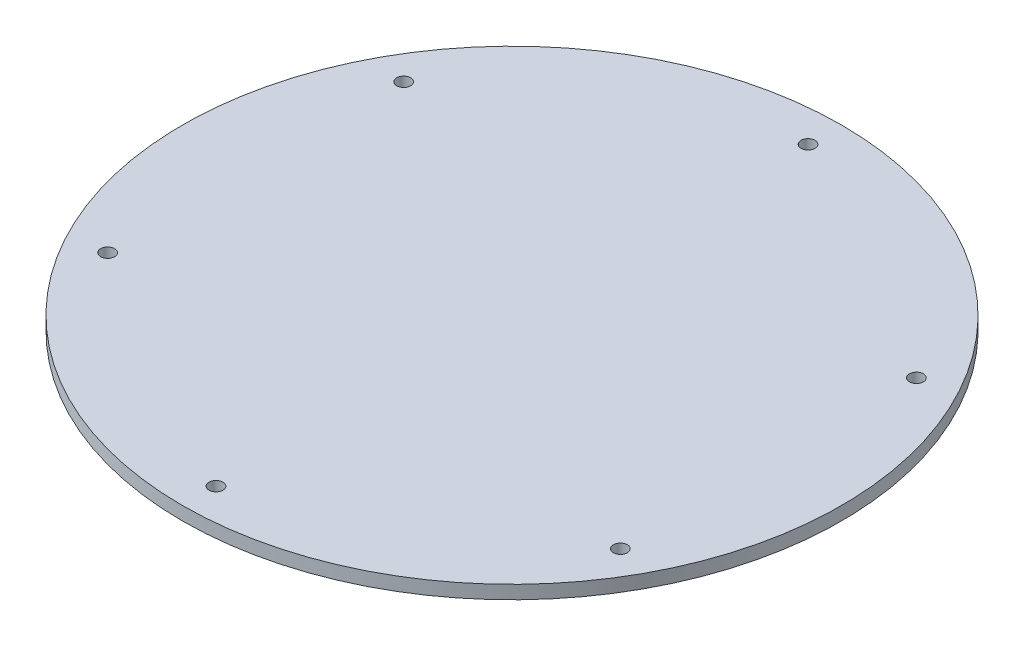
ISO-10303-21;
HEADER;
FILE_DESCRIPTION(('STEP AP214'),'2;1');
FILE_NAME('part.step','',(''),(''),'','','');
FILE_SCHEMA(('AUTOMOTIVE_DESIGN { 1 0 10303 214 1 1 1 1 }'));
ENDSEC;
DATA;
#1=APPLICATION_CONTEXT('core data for automotive mechanical design processes');
#2=APPLICATION_PROTOCOL_DEFINITION('international standard','automotive_design',2000,#1);
#3=PRODUCT_CONTEXT('',#1,'mechanical');
#4=PRODUCT('Part','Part','',(#3));
#5=PRODUCT_RELATED_PRODUCT_CATEGORY('part','',(#4));
#6=PRODUCT_DEFINITION_FORMATION('','',#4);
#7=PRODUCT_DEFINITION_CONTEXT('part definition',#1,'design');
#8=PRODUCT_DEFINITION('design','',#6,#7);
#9=PRODUCT_DEFINITION_SHAPE('','',#8);
#10=(LENGTH_UNIT() NAMED_UNIT(*) SI_UNIT(.MILLI.,.METRE.));
#11=(NAMED_UNIT(*) PLANE_ANGLE_UNIT() SI_UNIT($,.RADIAN.));
#12=(NAMED_UNIT(*) SI_UNIT($,.STERADIAN.) SOLID_ANGLE_UNIT());
#13=UNCERTAINTY_MEASURE_WITH_UNIT(LENGTH_MEASURE(1.E-05),#10,'distance_accuracy_value','');
#14=(GEOMETRIC_REPRESENTATION_CONTEXT(3) GLOBAL_UNCERTAINTY_ASSIGNED_CONTEXT((#13)) GLOBAL_UNIT_ASSIGNED_CONTEXT((#10,
#11,#12)) REPRESENTATION_CONTEXT('',''));
#15=CARTESIAN_POINT('',(0.,0.,0.));
#16=DIRECTION('',(0.,0.,1.));
#17=DIRECTION('',(1.,0.,0.));
#18=AXIS2_PLACEMENT_3D('',#15,#16,#17);
#19=CARTESIAN_POINT('',(0.,6.096,0.));
#20=DIRECTION('',(0.,1.,0.));
#21=DIRECTION('',(0.,0.,1.));
#22=AXIS2_PLACEMENT_3D('',#19,#20,#21);
#23=PLANE('',#22);
#24=CARTESIAN_POINT('',(116.58433985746,6.096,67.3100000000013));
#25=DIRECTION('',(0.,1.,0.));
#26=DIRECTION('',(0.,0.,1.));
#27=AXIS2_PLACEMENT_3D('',#24,#25,#26);
#28=CIRCLE('',#27,3.17500000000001);
#29=CARTESIAN_POINT('',(116.58433985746,6.096,64.1350000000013));
#30=VERTEX_POINT('',#29);
#31=EDGE_CURVE('E63',#30,#30,#28,.T.);
#32=ORIENTED_EDGE('',*,*,#31,.F.);
#33=EDGE_LOOP('',(#32));
#34=FACE_BOUND('',#33,.T.);
#35=CARTESIAN_POINT('',(9.29811783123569E-13,6.096,-134.62));
#36=DIRECTION('',(0.,1.,0.));
#37=DIRECTION('',(0.,0.,1.));
#38=AXIS2_PLACEMENT_3D('',#35,#36,#37);
#39=CIRCLE('',#38,3.17500000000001);
#40=CARTESIAN_POINT('',(9.29811783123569E-13,6.096,-137.795));
#41=VERTEX_POINT('',#40);
#42=EDGE_CURVE('E51',#41,#41,#39,.T.);
#43=ORIENTED_EDGE('',*,*,#42,.F.);
#44=EDGE_LOOP('',(#43));
#45=FACE_BOUND('',#44,.T.);
#46=CARTESIAN_POINT('',(-116.584339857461,6.096,67.3099999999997));
#47=DIRECTION('',(0.,1.,0.));
#48=DIRECTION('',(0.,0.,1.));
#49=AXIS2_PLACEMENT_3D('',#46,#47,#48);
#50=CIRCLE('',#49,3.175);
#51=CARTESIAN_POINT('',(-116.584339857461,6.096,64.1349999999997));
#52=VERTEX_POINT('',#51);
#53=EDGE_CURVE('E40',#52,#52,#50,.T.);
#54=ORIENTED_EDGE('',*,*,#53,.F.);
#55=EDGE_LOOP('',(#54));
#56=FACE_BOUND('',#55,.T.);
#57=CARTESIAN_POINT('',(0.,6.096,0.));
#58=DIRECTION('',(0.,1.,0.));
#59=DIRECTION('',(0.,0.,1.));
#60=AXIS2_PLACEMENT_3D('',#57,#58,#59);
#61=CIRCLE('',#60,149.86);
#62=CARTESIAN_POINT('',(0.,6.096,-149.86));
#63=VERTEX_POINT('',#62);
#64=EDGE_CURVE('E10',#63,#63,#61,.T.);
#65=ORIENTED_EDGE('',*,*,#64,.T.);
#66=EDGE_LOOP('',(#65));
#67=FACE_BOUND('',#66,.T.);
#68=CARTESIAN_POINT('',(-116.584339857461,6.096,-67.3100000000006));
#69=DIRECTION('',(0.,1.,0.));
#70=DIRECTION('',(0.,0.,1.));
#71=AXIS2_PLACEMENT_3D('',#68,#69,#70);
#72=CIRCLE('',#71,3.17499999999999);
#73=CARTESIAN_POINT('',(-116.584339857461,6.096,-70.4850000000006));
#74=VERTEX_POINT('',#73);
#75=EDGE_CURVE('E45',#74,#74,#72,.T.);
#76=ORIENTED_EDGE('',*,*,#75,.F.);
#77=EDGE_LOOP('',(#76));
#78=FACE_BOUND('',#77,.T.);
#79=CARTESIAN_POINT('',(116.584339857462,6.096,-67.3099999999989));
#80=DIRECTION('',(0.,1.,0.));
#81=DIRECTION('',(0.,0.,1.));
#82=AXIS2_PLACEMENT_3D('',#79,#80,#81);
#83=CIRCLE('',#82,3.175);
#84=CARTESIAN_POINT('',(116.584339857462,6.096,-70.4849999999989));
#85=VERTEX_POINT('',#84);
#86=EDGE_CURVE('E57',#85,#85,#83,.T.);
#87=ORIENTED_EDGE('',*,*,#86,.F.);
#88=EDGE_LOOP('',(#87));
#89=FACE_BOUND('',#88,.T.);
#90=CARTESIAN_POINT('',(-1.88044024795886E-12,6.096,134.62));
#91=DIRECTION('',(0.,1.,0.));
#92=DIRECTION('',(0.,0.,1.));
#93=AXIS2_PLACEMENT_3D('',#90,#91,#92);
#94=CIRCLE('',#93,3.17499999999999);
#95=CARTESIAN_POINT('',(-1.88044024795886E-12,6.096,131.445));
#96=VERTEX_POINT('',#95);
#97=EDGE_CURVE('E69',#96,#96,#94,.T.);
#98=ORIENTED_EDGE('',*,*,#97,.F.);
#99=EDGE_LOOP('',(#98));
#100=FACE_BOUND('',#99,.T.);
#101=ADVANCED_FACE('F29',(#34,#45,#56,#67,#78,#89,#100),#23,.T.);
#102=CARTESIAN_POINT('',(0.,0.,0.));
#103=DIRECTION('',(0.,1.,0.));
#104=DIRECTION('',(0.,0.,1.));
#105=AXIS2_PLACEMENT_3D('',#102,#103,#104);
#106=PLANE('',#105);
#107=CARTESIAN_POINT('',(116.58433985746,0.,67.3100000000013));
#108=DIRECTION('',(0.,1.,0.));
#109=DIRECTION('',(0.,0.,1.));
#110=AXIS2_PLACEMENT_3D('',#107,#108,#109);
#111=CIRCLE('',#110,3.17500000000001);
#112=CARTESIAN_POINT('',(116.58433985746,0.,64.1350000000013));
#113=VERTEX_POINT('',#112);
#114=EDGE_CURVE('E66',#113,#113,#111,.T.);
#115=ORIENTED_EDGE('',*,*,#114,.T.);
#116=EDGE_LOOP('',(#115));
#117=FACE_BOUND('',#116,.T.);
#118=CARTESIAN_POINT('',(9.29811783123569E-13,0.,-134.62));
#119=DIRECTION('',(0.,1.,0.));
#120=DIRECTION('',(0.,0.,1.));
#121=AXIS2_PLACEMENT_3D('',#118,#119,#120);
#122=CIRCLE('',#121,3.17500000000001);
#123=CARTESIAN_POINT('',(9.29811783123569E-13,0.,-137.795));
#124=VERTEX_POINT('',#123);
#125=EDGE_CURVE('E54',#124,#124,#122,.T.);
#126=ORIENTED_EDGE('',*,*,#125,.T.);
#127=EDGE_LOOP('',(#126));
#128=FACE_BOUND('',#127,.T.);
#129=CARTESIAN_POINT('',(-116.584339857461,0.,67.3099999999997));
#130=DIRECTION('',(0.,1.,0.));
#131=DIRECTION('',(0.,0.,1.));
#132=AXIS2_PLACEMENT_3D('',#129,#130,#131);
#133=CIRCLE('',#132,3.175);
#134=CARTESIAN_POINT('',(-116.584339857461,0.,64.1349999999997));
#135=VERTEX_POINT('',#134);
#136=EDGE_CURVE('E42',#135,#135,#133,.T.);
#137=ORIENTED_EDGE('',*,*,#136,.T.);
#138=EDGE_LOOP('',(#137));
#139=FACE_BOUND('',#138,.T.);
#140=CARTESIAN_POINT('',(0.,0.,0.));
#141=DIRECTION('',(0.,1.,0.));
#142=DIRECTION('',(0.,0.,1.));
#143=AXIS2_PLACEMENT_3D('',#140,#141,#142);
#144=CIRCLE('',#143,149.86);
#145=CARTESIAN_POINT('',(0.,0.,-149.86));
#146=VERTEX_POINT('',#145);
#147=EDGE_CURVE('E33',#146,#146,#144,.T.);
#148=ORIENTED_EDGE('',*,*,#147,.F.);
#149=EDGE_LOOP('',(#148));
#150=FACE_BOUND('',#149,.T.);
#151=CARTESIAN_POINT('',(-116.584339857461,0.,-67.3100000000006));
#152=DIRECTION('',(0.,1.,0.));
#153=DIRECTION('',(0.,0.,1.));
#154=AXIS2_PLACEMENT_3D('',#151,#152,#153);
#155=CIRCLE('',#154,3.17499999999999);
#156=CARTESIAN_POINT('',(-116.584339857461,0.,-70.4850000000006));
#157=VERTEX_POINT('',#156);
#158=EDGE_CURVE('E48',#157,#157,#155,.T.);
#159=ORIENTED_EDGE('',*,*,#158,.T.);
#160=EDGE_LOOP('',(#159));
#161=FACE_BOUND('',#160,.T.);
#162=CARTESIAN_POINT('',(116.584339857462,0.,-67.3099999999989));
#163=DIRECTION('',(0.,1.,0.));
#164=DIRECTION('',(0.,0.,1.));
#165=AXIS2_PLACEMENT_3D('',#162,#163,#164);
#166=CIRCLE('',#165,3.175);
#167=CARTESIAN_POINT('',(116.584339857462,0.,-70.4849999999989));
#168=VERTEX_POINT('',#167);
#169=EDGE_CURVE('E60',#168,#168,#166,.T.);
#170=ORIENTED_EDGE('',*,*,#169,.T.);
#171=EDGE_LOOP('',(#170));
#172=FACE_BOUND('',#171,.T.);
#173=CARTESIAN_POINT('',(-1.88044024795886E-12,0.,134.62));
#174=DIRECTION('',(0.,1.,0.));
#175=DIRECTION('',(0.,0.,1.));
#176=AXIS2_PLACEMENT_3D('',#173,#174,#175);
#177=CIRCLE('',#176,3.17499999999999);
#178=CARTESIAN_POINT('',(-1.88044024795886E-12,0.,131.445));
#179=VERTEX_POINT('',#178);
#180=EDGE_CURVE('E72',#179,#179,#177,.T.);
#181=ORIENTED_EDGE('',*,*,#180,.T.);
#182=EDGE_LOOP('',(#181));
#183=FACE_BOUND('',#182,.T.);
#184=ADVANCED_FACE('F82',(#117,#128,#139,#150,#161,#172,#183),#106,.F.);
#185=CARTESIAN_POINT('',(0.,6.096,0.));
#186=DIRECTION('',(0.,-1.,0.));
#187=DIRECTION('',(0.,0.,-1.));
#188=AXIS2_PLACEMENT_3D('',#185,#186,#187);
#189=CYLINDRICAL_SURFACE('',#188,149.86);
#190=CARTESIAN_POINT('',(0.,6.096,-149.86));
#191=CARTESIAN_POINT('',(0.,6.0325,-149.86));
#192=CARTESIAN_POINT('',(0.,5.969,-149.86));
#193=CARTESIAN_POINT('',(0.,5.842,-149.86));
#194=CARTESIAN_POINT('',(0.,5.7785,-149.86));
#195=CARTESIAN_POINT('',(0.,5.6515,-149.86));
#196=CARTESIAN_POINT('',(0.,5.588,-149.86));
#197=CARTESIAN_POINT('',(0.,5.461,-149.86));
#198=CARTESIAN_POINT('',(0.,5.3975,-149.86));
#199=CARTESIAN_POINT('',(0.,5.2705,-149.86));
#200=CARTESIAN_POINT('',(0.,5.207,-149.86));
#201=CARTESIAN_POINT('',(0.,5.08,-149.86));
#202=CARTESIAN_POINT('',(0.,5.0165,-149.86));
#203=CARTESIAN_POINT('',(0.,4.8895,-149.86));
#204=CARTESIAN_POINT('',(0.,4.826,-149.86));
#205=CARTESIAN_POINT('',(0.,4.699,-149.86));
#206=CARTESIAN_POINT('',(0.,4.6355,-149.86));
#207=CARTESIAN_POINT('',(0.,4.5085,-149.86));
#208=CARTESIAN_POINT('',(0.,4.445,-149.86));
#209=CARTESIAN_POINT('',(0.,4.318,-149.86));
#210=CARTESIAN_POINT('',(0.,4.2545,-149.86));
#211=CARTESIAN_POINT('',(0.,4.1275,-149.86));
#212=CARTESIAN_POINT('',(0.,4.064,-149.86));
#213=CARTESIAN_POINT('',(0.,3.937,-149.86));
#214=CARTESIAN_POINT('',(0.,3.8735,-149.86));
#215=CARTESIAN_POINT('',(0.,3.7465,-149.86));
#216=CARTESIAN_POINT('',(0.,3.683,-149.86));
#217=CARTESIAN_POINT('',(0.,3.556,-149.86));
#218=CARTESIAN_POINT('',(0.,3.4925,-149.86));
#219=CARTESIAN_POINT('',(0.,3.3655,-149.86));
#220=CARTESIAN_POINT('',(0.,3.302,-149.86));
#221=CARTESIAN_POINT('',(0.,3.175,-149.86));
#222=CARTESIAN_POINT('',(0.,3.1115,-149.86));
#223=CARTESIAN_POINT('',(0.,2.9845,-149.86));
#224=CARTESIAN_POINT('',(0.,2.921,-149.86));
#225=CARTESIAN_POINT('',(0.,2.794,-149.86));
#226=CARTESIAN_POINT('',(0.,2.7305,-149.86));
#227=CARTESIAN_POINT('',(0.,2.6035,-149.86));
#228=CARTESIAN_POINT('',(0.,2.54,-149.86));
#229=CARTESIAN_POINT('',(0.,2.413,-149.86));
#230=CARTESIAN_POINT('',(0.,2.3495,-149.86));
#231=CARTESIAN_POINT('',(0.,2.2225,-149.86));
#232=CARTESIAN_POINT('',(0.,2.159,-149.86));
#233=CARTESIAN_POINT('',(0.,2.032,-149.86));
#234=CARTESIAN_POINT('',(0.,1.9685,-149.86));
#235=CARTESIAN_POINT('',(0.,1.8415,-149.86));
#236=CARTESIAN_POINT('',(0.,1.778,-149.86));
#237=CARTESIAN_POINT('',(0.,1.651,-149.86));
#238=CARTESIAN_POINT('',(0.,1.5875,-149.86));
#239=CARTESIAN_POINT('',(0.,1.4605,-149.86));
#240=CARTESIAN_POINT('',(0.,1.397,-149.86));
#241=CARTESIAN_POINT('',(0.,1.27,-149.86));
#242=CARTESIAN_POINT('',(0.,1.2065,-149.86));
#243=CARTESIAN_POINT('',(0.,1.0795,-149.86));
#244=CARTESIAN_POINT('',(0.,1.016,-149.86));
#245=CARTESIAN_POINT('',(0.,0.889,-149.86));
#246=CARTESIAN_POINT('',(0.,0.8255,-149.86));
#247=CARTESIAN_POINT('',(0.,0.6985,-149.86));
#248=CARTESIAN_POINT('',(0.,0.635,-149.86));
#249=CARTESIAN_POINT('',(0.,0.508,-149.86));
#250=CARTESIAN_POINT('',(0.,0.4445,-149.86));
#251=CARTESIAN_POINT('',(0.,0.3175,-149.86));
#252=CARTESIAN_POINT('',(0.,0.254,-149.86));
#253=CARTESIAN_POINT('',(0.,0.127,-149.86));
#254=CARTESIAN_POINT('',(0.,0.0634999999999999,-149.86));
#255=CARTESIAN_POINT('',(0.,0.,-149.86));
#256=B_SPLINE_CURVE_WITH_KNOTS('',3,(#190,#191,#192,#193,#194,#195,#196,#197,#198,#199,#200,
#201,#202,#203,#204,#205,#206,#207,#208,#209,#210,#211,#212,#213,#214,#215,#216,#217,#218,#219,
#220,#221,#222,#223,#224,#225,#226,#227,#228,#229,#230,#231,#232,#233,#234,#235,#236,#237,#238,
#239,#240,#241,#242,#243,#244,#245,#246,#247,#248,#249,#250,#251,#252,#253,#254,#255),
.UNSPECIFIED.,.F.,.F.,(4,2,2,2,2,2,2,2,2,2,2,2,2,2,2,2,2,2,2,2,2,2,2,2,2,2,2,2,2,2,2,2,4),(0.,
0.1905,0.380999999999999,0.571499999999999,0.762,0.952499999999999,1.143,1.3335,1.524,1.7145,
1.905,2.0955,2.286,2.4765,2.667,2.8575,3.048,3.2385,3.429,3.6195,3.81,4.0005,4.191,4.3815,4.572,
4.7625,4.953,5.1435,5.334,5.5245,5.715,5.9055,6.096),.UNSPECIFIED.);
#257=EDGE_CURVE('BSEAM31',#63,#146,#256,.T.);
#258=ORIENTED_EDGE('',*,*,#64,.F.);
#259=ORIENTED_EDGE('',*,*,#147,.T.);
#260=ORIENTED_EDGE('',*,*,#257,.T.);
#261=ORIENTED_EDGE('',*,*,#257,.F.);
#262=EDGE_LOOP('',(#258,#260,#259,#261));
#263=FACE_BOUND('',#262,.T.);
#264=ADVANCED_FACE('F31',(#263),#189,.T.);
#265=CARTESIAN_POINT('',(-116.584339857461,6.096,67.3099999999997));
#266=DIRECTION('',(0.,-1.,0.));
#267=DIRECTION('',(0.,0.,-1.));
#268=AXIS2_PLACEMENT_3D('',#265,#266,#267);
#269=CYLINDRICAL_SURFACE('',#268,3.175);
#270=CARTESIAN_POINT('',(-116.584339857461,6.096,64.1349999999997));
#271=CARTESIAN_POINT('',(-116.584339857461,6.0325,64.1349999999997));
#272=CARTESIAN_POINT('',(-116.584339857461,5.969,64.1349999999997));
#273=CARTESIAN_POINT('',(-116.584339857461,5.842,64.1349999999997));
#274=CARTESIAN_POINT('',(-116.584339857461,5.7785,64.1349999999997));
#275=CARTESIAN_POINT('',(-116.584339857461,5.6515,64.1349999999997));
#276=CARTESIAN_POINT('',(-116.584339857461,5.588,64.1349999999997));
#277=CARTESIAN_POINT('',(-116.584339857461,5.461,64.1349999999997));
#278=CARTESIAN_POINT('',(-116.584339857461,5.3975,64.1349999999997));
#279=CARTESIAN_POINT('',(-116.584339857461,5.2705,64.1349999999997));
#280=CARTESIAN_POINT('',(-116.584339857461,5.207,64.1349999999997));
#281=CARTESIAN_POINT('',(-116.584339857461,5.08,64.1349999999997));
#282=CARTESIAN_POINT('',(-116.584339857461,5.0165,64.1349999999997));
#283=CARTESIAN_POINT('',(-116.584339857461,4.8895,64.1349999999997));
#284=CARTESIAN_POINT('',(-116.584339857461,4.826,64.1349999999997));
#285=CARTESIAN_POINT('',(-116.584339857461,4.699,64.1349999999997));
#286=CARTESIAN_POINT('',(-116.584339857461,4.6355,64.1349999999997));
#287=CARTESIAN_POINT('',(-116.584339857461,4.5085,64.1349999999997));
#288=CARTESIAN_POINT('',(-116.584339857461,4.445,64.1349999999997));
#289=CARTESIAN_POINT('',(-116.584339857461,4.318,64.1349999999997));
#290=CARTESIAN_POINT('',(-116.584339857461,4.2545,64.1349999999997));
#291=CARTESIAN_POINT('',(-116.584339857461,4.1275,64.1349999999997));
#292=CARTESIAN_POINT('',(-116.584339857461,4.064,64.1349999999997));
#293=CARTESIAN_POINT('',(-116.584339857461,3.937,64.1349999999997));
#294=CARTESIAN_POINT('',(-116.584339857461,3.8735,64.1349999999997));
#295=CARTESIAN_POINT('',(-116.584339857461,3.7465,64.1349999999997));
#296=CARTESIAN_POINT('',(-116.584339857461,3.683,64.1349999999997));
#297=CARTESIAN_POINT('',(-116.584339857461,3.556,64.1349999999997));
#298=CARTESIAN_POINT('',(-116.584339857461,3.4925,64.1349999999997));
#299=CARTESIAN_POINT('',(-116.584339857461,3.3655,64.1349999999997));
#300=CARTESIAN_POINT('',(-116.584339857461,3.302,64.1349999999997));
#301=CARTESIAN_POINT('',(-116.584339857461,3.175,64.1349999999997));
#302=CARTESIAN_POINT('',(-116.584339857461,3.1115,64.1349999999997));
#303=CARTESIAN_POINT('',(-116.584339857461,2.9845,64.1349999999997));
#304=CARTESIAN_POINT('',(-116.584339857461,2.921,64.1349999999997));
#305=CARTESIAN_POINT('',(-116.584339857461,2.794,64.1349999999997));
#306=CARTESIAN_POINT('',(-116.584339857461,2.7305,64.1349999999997));
#307=CARTESIAN_POINT('',(-116.584339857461,2.6035,64.1349999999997));
#308=CARTESIAN_POINT('',(-116.584339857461,2.54,64.1349999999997));
#309=CARTESIAN_POINT('',(-116.584339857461,2.413,64.1349999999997));
#310=CARTESIAN_POINT('',(-116.584339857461,2.3495,64.1349999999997));
#311=CARTESIAN_POINT('',(-116.584339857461,2.2225,64.1349999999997));
#312=CARTESIAN_POINT('',(-116.584339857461,2.159,64.1349999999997));
#313=CARTESIAN_POINT('',(-116.584339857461,2.032,64.1349999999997));
#314=CARTESIAN_POINT('',(-116.584339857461,1.9685,64.1349999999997));
#315=CARTESIAN_POINT('',(-116.584339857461,1.8415,64.1349999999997));
#316=CARTESIAN_POINT('',(-116.584339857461,1.778,64.1349999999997));
#317=CARTESIAN_POINT('',(-116.584339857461,1.651,64.1349999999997));
#318=CARTESIAN_POINT('',(-116.584339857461,1.5875,64.1349999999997));
#319=CARTESIAN_POINT('',(-116.584339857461,1.4605,64.1349999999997));
#320=CARTESIAN_POINT('',(-116.584339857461,1.397,64.1349999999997));
#321=CARTESIAN_POINT('',(-116.584339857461,1.27,64.1349999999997));
#322=CARTESIAN_POINT('',(-116.584339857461,1.2065,64.1349999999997));
#323=CARTESIAN_POINT('',(-116.584339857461,1.0795,64.1349999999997));
#324=CARTESIAN_POINT('',(-116.584339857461,1.016,64.1349999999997));
#325=CARTESIAN_POINT('',(-116.584339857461,0.889,64.1349999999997));
#326=CARTESIAN_POINT('',(-116.584339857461,0.8255,64.1349999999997));
#327=CARTESIAN_POINT('',(-116.584339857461,0.6985,64.1349999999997));
#328=CARTESIAN_POINT('',(-116.584339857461,0.635,64.1349999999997));
#329=CARTESIAN_POINT('',(-116.584339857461,0.508,64.1349999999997));
#330=CARTESIAN_POINT('',(-116.584339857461,0.4445,64.1349999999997));
#331=CARTESIAN_POINT('',(-116.584339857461,0.3175,64.1349999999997));
#332=CARTESIAN_POINT('',(-116.584339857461,0.254,64.1349999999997));
#333=CARTESIAN_POINT('',(-116.584339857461,0.127,64.1349999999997));
#334=CARTESIAN_POINT('',(-116.584339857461,0.0634999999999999,64.1349999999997));
#335=CARTESIAN_POINT('',(-116.584339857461,0.,64.1349999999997));
#336=B_SPLINE_CURVE_WITH_KNOTS('',3,(#270,#271,#272,#273,#274,#275,#276,#277,#278,#279,#280,
#281,#282,#283,#284,#285,#286,#287,#288,#289,#290,#291,#292,#293,#294,#295,#296,#297,#298,#299,
#300,#301,#302,#303,#304,#305,#306,#307,#308,#309,#310,#311,#312,#313,#314,#315,#316,#317,#318,
#319,#320,#321,#322,#323,#324,#325,#326,#327,#328,#329,#330,#331,#332,#333,#334,#335),
.UNSPECIFIED.,.F.,.F.,(4,2,2,2,2,2,2,2,2,2,2,2,2,2,2,2,2,2,2,2,2,2,2,2,2,2,2,2,2,2,2,2,4),(0.,
0.1905,0.380999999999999,0.571499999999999,0.762,0.952499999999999,1.143,1.3335,1.524,1.7145,
1.905,2.0955,2.286,2.4765,2.667,2.8575,3.048,3.2385,3.429,3.6195,3.81,4.0005,4.191,4.3815,4.572,
4.7625,4.953,5.1435,5.334,5.5245,5.715,5.9055,6.096),.UNSPECIFIED.);
#337=EDGE_CURVE('BSEAM92',#52,#135,#336,.T.);
#338=ORIENTED_EDGE('',*,*,#53,.T.);
#339=ORIENTED_EDGE('',*,*,#136,.F.);
#340=ORIENTED_EDGE('',*,*,#337,.T.);
#341=ORIENTED_EDGE('',*,*,#337,.F.);
#342=EDGE_LOOP('',(#338,#340,#339,#341));
#343=FACE_BOUND('',#342,.T.);
#344=ADVANCED_FACE('F92',(#343),#269,.F.);
#345=CARTESIAN_POINT('',(-116.584339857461,6.096,-67.3100000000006));
#346=DIRECTION('',(0.,-1.,0.));
#347=DIRECTION('',(0.,0.,-1.));
#348=AXIS2_PLACEMENT_3D('',#345,#346,#347);
#349=CYLINDRICAL_SURFACE('',#348,3.17499999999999);
#350=CARTESIAN_POINT('',(-116.584339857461,6.096,-70.4850000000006));
#351=CARTESIAN_POINT('',(-116.584339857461,6.0325,-70.4850000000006));
#352=CARTESIAN_POINT('',(-116.584339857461,5.969,-70.4850000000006));
#353=CARTESIAN_POINT('',(-116.584339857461,5.842,-70.4850000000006));
#354=CARTESIAN_POINT('',(-116.584339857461,5.7785,-70.4850000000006));
#355=CARTESIAN_POINT('',(-116.584339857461,5.6515,-70.4850000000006));
#356=CARTESIAN_POINT('',(-116.584339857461,5.588,-70.4850000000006));
#357=CARTESIAN_POINT('',(-116.584339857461,5.461,-70.4850000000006));
#358=CARTESIAN_POINT('',(-116.584339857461,5.3975,-70.4850000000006));
#359=CARTESIAN_POINT('',(-116.584339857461,5.2705,-70.4850000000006));
#360=CARTESIAN_POINT('',(-116.584339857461,5.207,-70.4850000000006));
#361=CARTESIAN_POINT('',(-116.584339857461,5.08,-70.4850000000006));
#362=CARTESIAN_POINT('',(-116.584339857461,5.0165,-70.4850000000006));
#363=CARTESIAN_POINT('',(-116.584339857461,4.8895,-70.4850000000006));
#364=CARTESIAN_POINT('',(-116.584339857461,4.826,-70.4850000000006));
#365=CARTESIAN_POINT('',(-116.584339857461,4.699,-70.4850000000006));
#366=CARTESIAN_POINT('',(-116.584339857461,4.6355,-70.4850000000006));
#367=CARTESIAN_POINT('',(-116.584339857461,4.5085,-70.4850000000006));
#368=CARTESIAN_POINT('',(-116.584339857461,4.445,-70.4850000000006));
#369=CARTESIAN_POINT('',(-116.584339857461,4.318,-70.4850000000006));
#370=CARTESIAN_POINT('',(-116.584339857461,4.2545,-70.4850000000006));
#371=CARTESIAN_POINT('',(-116.584339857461,4.1275,-70.4850000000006));
#372=CARTESIAN_POINT('',(-116.584339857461,4.064,-70.4850000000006));
#373=CARTESIAN_POINT('',(-116.584339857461,3.937,-70.4850000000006));
#374=CARTESIAN_POINT('',(-116.584339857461,3.8735,-70.4850000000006));
#375=CARTESIAN_POINT('',(-116.584339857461,3.7465,-70.4850000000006));
#376=CARTESIAN_POINT('',(-116.584339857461,3.683,-70.4850000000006));
#377=CARTESIAN_POINT('',(-116.584339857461,3.556,-70.4850000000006));
#378=CARTESIAN_POINT('',(-116.584339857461,3.4925,-70.4850000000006));
#379=CARTESIAN_POINT('',(-116.584339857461,3.3655,-70.4850000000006));
#380=CARTESIAN_POINT('',(-116.584339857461,3.302,-70.4850000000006));
#381=CARTESIAN_POINT('',(-116.584339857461,3.175,-70.4850000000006));
#382=CARTESIAN_POINT('',(-116.584339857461,3.1115,-70.4850000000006));
#383=CARTESIAN_POINT('',(-116.584339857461,2.9845,-70.4850000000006));
#384=CARTESIAN_POINT('',(-116.584339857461,2.921,-70.4850000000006));
#385=CARTESIAN_POINT('',(-116.584339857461,2.794,-70.4850000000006));
#386=CARTESIAN_POINT('',(-116.584339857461,2.7305,-70.4850000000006));
#387=CARTESIAN_POINT('',(-116.584339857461,2.6035,-70.4850000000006));
#388=CARTESIAN_POINT('',(-116.584339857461,2.54,-70.4850000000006));
#389=CARTESIAN_POINT('',(-116.584339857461,2.413,-70.4850000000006));
#390=CARTESIAN_POINT('',(-116.584339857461,2.3495,-70.4850000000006));
#391=CARTESIAN_POINT('',(-116.584339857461,2.2225,-70.4850000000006));
#392=CARTESIAN_POINT('',(-116.584339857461,2.159,-70.4850000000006));
#393=CARTESIAN_POINT('',(-116.584339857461,2.032,-70.4850000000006));
#394=CARTESIAN_POINT('',(-116.584339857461,1.9685,-70.4850000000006));
#395=CARTESIAN_POINT('',(-116.584339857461,1.8415,-70.4850000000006));
#396=CARTESIAN_POINT('',(-116.584339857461,1.778,-70.4850000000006));
#397=CARTESIAN_POINT('',(-116.584339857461,1.651,-70.4850000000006));
#398=CARTESIAN_POINT('',(-116.584339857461,1.5875,-70.4850000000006));
#399=CARTESIAN_POINT('',(-116.584339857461,1.4605,-70.4850000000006));
#400=CARTESIAN_POINT('',(-116.584339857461,1.397,-70.4850000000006));
#401=CARTESIAN_POINT('',(-116.584339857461,1.27,-70.4850000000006));
#402=CARTESIAN_POINT('',(-116.584339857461,1.2065,-70.4850000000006));
#403=CARTESIAN_POINT('',(-116.584339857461,1.0795,-70.4850000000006));
#404=CARTESIAN_POINT('',(-116.584339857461,1.016,-70.4850000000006));
#405=CARTESIAN_POINT('',(-116.584339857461,0.889,-70.4850000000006));
#406=CARTESIAN_POINT('',(-116.584339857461,0.8255,-70.4850000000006));
#407=CARTESIAN_POINT('',(-116.584339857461,0.6985,-70.4850000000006));
#408=CARTESIAN_POINT('',(-116.584339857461,0.635,-70.4850000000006));
#409=CARTESIAN_POINT('',(-116.584339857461,0.508,-70.4850000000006));
#410=CARTESIAN_POINT('',(-116.584339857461,0.4445,-70.4850000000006));
#411=CARTESIAN_POINT('',(-116.584339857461,0.3175,-70.4850000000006));
#412=CARTESIAN_POINT('',(-116.584339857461,0.254,-70.4850000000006));
#413=CARTESIAN_POINT('',(-116.584339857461,0.127,-70.4850000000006));
#414=CARTESIAN_POINT('',(-116.584339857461,0.0634999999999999,-70.4850000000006));
#415=CARTESIAN_POINT('',(-116.584339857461,0.,-70.4850000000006));
#416=B_SPLINE_CURVE_WITH_KNOTS('',3,(#350,#351,#352,#353,#354,#355,#356,#357,#358,#359,#360,
#361,#362,#363,#364,#365,#366,#367,#368,#369,#370,#371,#372,#373,#374,#375,#376,#377,#378,#379,
#380,#381,#382,#383,#384,#385,#386,#387,#388,#389,#390,#391,#392,#393,#394,#395,#396,#397,#398,
#399,#400,#401,#402,#403,#404,#405,#406,#407,#408,#409,#410,#411,#412,#413,#414,#415),
.UNSPECIFIED.,.F.,.F.,(4,2,2,2,2,2,2,2,2,2,2,2,2,2,2,2,2,2,2,2,2,2,2,2,2,2,2,2,2,2,2,2,4),(0.,
0.1905,0.380999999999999,0.571499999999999,0.762,0.952499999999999,1.143,1.3335,1.524,1.7145,
1.905,2.0955,2.286,2.4765,2.667,2.8575,3.048,3.2385,3.429,3.6195,3.81,4.0005,4.191,4.3815,4.572,
4.7625,4.953,5.1435,5.334,5.5245,5.715,5.9055,6.096),.UNSPECIFIED.);
#417=EDGE_CURVE('BSEAM95',#74,#157,#416,.T.);
#418=ORIENTED_EDGE('',*,*,#75,.T.);
#419=ORIENTED_EDGE('',*,*,#158,.F.);
#420=ORIENTED_EDGE('',*,*,#417,.T.);
#421=ORIENTED_EDGE('',*,*,#417,.F.);
#422=EDGE_LOOP('',(#418,#420,#419,#421));
#423=FACE_BOUND('',#422,.T.);
#424=ADVANCED_FACE('F95',(#423),#349,.F.);
#425=CARTESIAN_POINT('',(9.29811783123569E-13,6.096,-134.62));
#426=DIRECTION('',(0.,-1.,0.));
#427=DIRECTION('',(0.,0.,-1.));
#428=AXIS2_PLACEMENT_3D('',#425,#426,#427);
#429=CYLINDRICAL_SURFACE('',#428,3.17500000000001);
#430=CARTESIAN_POINT('',(9.29811783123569E-13,6.096,-137.795));
#431=CARTESIAN_POINT('',(9.29811783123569E-13,6.0325,-137.795));
#432=CARTESIAN_POINT('',(9.29811783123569E-13,5.969,-137.795));
#433=CARTESIAN_POINT('',(9.29811783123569E-13,5.842,-137.795));
#434=CARTESIAN_POINT('',(9.29811783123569E-13,5.7785,-137.795));
#435=CARTESIAN_POINT('',(9.29811783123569E-13,5.6515,-137.795));
#436=CARTESIAN_POINT('',(9.29811783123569E-13,5.588,-137.795));
#437=CARTESIAN_POINT('',(9.29811783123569E-13,5.461,-137.795));
#438=CARTESIAN_POINT('',(9.29811783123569E-13,5.3975,-137.795));
#439=CARTESIAN_POINT('',(9.29811783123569E-13,5.2705,-137.795));
#440=CARTESIAN_POINT('',(9.29811783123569E-13,5.207,-137.795));
#441=CARTESIAN_POINT('',(9.29811783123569E-13,5.08,-137.795));
#442=CARTESIAN_POINT('',(9.29811783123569E-13,5.0165,-137.795));
#443=CARTESIAN_POINT('',(9.29811783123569E-13,4.8895,-137.795));
#444=CARTESIAN_POINT('',(9.29811783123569E-13,4.826,-137.795));
#445=CARTESIAN_POINT('',(9.29811783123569E-13,4.699,-137.795));
#446=CARTESIAN_POINT('',(9.29811783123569E-13,4.6355,-137.795));
#447=CARTESIAN_POINT('',(9.29811783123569E-13,4.5085,-137.795));
#448=CARTESIAN_POINT('',(9.29811783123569E-13,4.445,-137.795));
#449=CARTESIAN_POINT('',(9.29811783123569E-13,4.318,-137.795));
#450=CARTESIAN_POINT('',(9.29811783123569E-13,4.2545,-137.795));
#451=CARTESIAN_POINT('',(9.29811783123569E-13,4.1275,-137.795));
#452=CARTESIAN_POINT('',(9.29811783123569E-13,4.064,-137.795));
#453=CARTESIAN_POINT('',(9.29811783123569E-13,3.937,-137.795));
#454=CARTESIAN_POINT('',(9.29811783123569E-13,3.8735,-137.795));
#455=CARTESIAN_POINT('',(9.29811783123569E-13,3.7465,-137.795));
#456=CARTESIAN_POINT('',(9.29811783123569E-13,3.683,-137.795));
#457=CARTESIAN_POINT('',(9.29811783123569E-13,3.556,-137.795));
#458=CARTESIAN_POINT('',(9.29811783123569E-13,3.4925,-137.795));
#459=CARTESIAN_POINT('',(9.29811783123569E-13,3.3655,-137.795));
#460=CARTESIAN_POINT('',(9.29811783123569E-13,3.302,-137.795));
#461=CARTESIAN_POINT('',(9.29811783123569E-13,3.175,-137.795));
#462=CARTESIAN_POINT('',(9.29811783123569E-13,3.1115,-137.795));
#463=CARTESIAN_POINT('',(9.29811783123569E-13,2.9845,-137.795));
#464=CARTESIAN_POINT('',(9.29811783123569E-13,2.921,-137.795));
#465=CARTESIAN_POINT('',(9.29811783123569E-13,2.794,-137.795));
#466=CARTESIAN_POINT('',(9.29811783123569E-13,2.7305,-137.795));
#467=CARTESIAN_POINT('',(9.29811783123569E-13,2.6035,-137.795));
#468=CARTESIAN_POINT('',(9.29811783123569E-13,2.54,-137.795));
#469=CARTESIAN_POINT('',(9.29811783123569E-13,2.413,-137.795));
#470=CARTESIAN_POINT('',(9.29811783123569E-13,2.3495,-137.795));
#471=CARTESIAN_POINT('',(9.29811783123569E-13,2.2225,-137.795));
#472=CARTESIAN_POINT('',(9.29811783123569E-13,2.159,-137.795));
#473=CARTESIAN_POINT('',(9.29811783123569E-13,2.032,-137.795));
#474=CARTESIAN_POINT('',(9.29811783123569E-13,1.9685,-137.795));
#475=CARTESIAN_POINT('',(9.29811783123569E-13,1.8415,-137.795));
#476=CARTESIAN_POINT('',(9.29811783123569E-13,1.778,-137.795));
#477=CARTESIAN_POINT('',(9.29811783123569E-13,1.651,-137.795));
#478=CARTESIAN_POINT('',(9.29811783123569E-13,1.5875,-137.795));
#479=CARTESIAN_POINT('',(9.29811783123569E-13,1.4605,-137.795));
#480=CARTESIAN_POINT('',(9.29811783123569E-13,1.397,-137.795));
#481=CARTESIAN_POINT('',(9.29811783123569E-13,1.27,-137.795));
#482=CARTESIAN_POINT('',(9.29811783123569E-13,1.2065,-137.795));
#483=CARTESIAN_POINT('',(9.29811783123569E-13,1.0795,-137.795));
#484=CARTESIAN_POINT('',(9.29811783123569E-13,1.016,-137.795));
#485=CARTESIAN_POINT('',(9.29811783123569E-13,0.889,-137.795));
#486=CARTESIAN_POINT('',(9.29811783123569E-13,0.8255,-137.795));
#487=CARTESIAN_POINT('',(9.29811783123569E-13,0.6985,-137.795));
#488=CARTESIAN_POINT('',(9.29811783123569E-13,0.635,-137.795));
#489=CARTESIAN_POINT('',(9.29811783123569E-13,0.508,-137.795));
#490=CARTESIAN_POINT('',(9.29811783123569E-13,0.4445,-137.795));
#491=CARTESIAN_POINT('',(9.29811783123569E-13,0.3175,-137.795));
#492=CARTESIAN_POINT('',(9.29811783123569E-13,0.254,-137.795));
#493=CARTESIAN_POINT('',(9.29811783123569E-13,0.127,-137.795));
#494=CARTESIAN_POINT('',(9.29811783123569E-13,0.0634999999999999,-137.795));
#495=CARTESIAN_POINT('',(9.29811783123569E-13,0.,-137.795));
#496=B_SPLINE_CURVE_WITH_KNOTS('',3,(#430,#431,#432,#433,#434,#435,#436,#437,#438,#439,#440,
#441,#442,#443,#444,#445,#446,#447,#448,#449,#450,#451,#452,#453,#454,#455,#456,#457,#458,#459,
#460,#461,#462,#463,#464,#465,#466,#467,#468,#469,#470,#471,#472,#473,#474,#475,#476,#477,#478,
#479,#480,#481,#482,#483,#484,#485,#486,#487,#488,#489,#490,#491,#492,#493,#494,#495),
.UNSPECIFIED.,.F.,.F.,(4,2,2,2,2,2,2,2,2,2,2,2,2,2,2,2,2,2,2,2,2,2,2,2,2,2,2,2,2,2,2,2,4),(0.,
0.1905,0.380999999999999,0.571499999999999,0.762,0.952499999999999,1.143,1.3335,1.524,1.7145,
1.905,2.0955,2.286,2.4765,2.667,2.8575,3.048,3.2385,3.429,3.6195,3.81,4.0005,4.191,4.3815,4.572,
4.7625,4.953,5.1435,5.334,5.5245,5.715,5.9055,6.096),.UNSPECIFIED.);
#497=EDGE_CURVE('BSEAM99',#41,#124,#496,.T.);
#498=ORIENTED_EDGE('',*,*,#42,.T.);
#499=ORIENTED_EDGE('',*,*,#125,.F.);
#500=ORIENTED_EDGE('',*,*,#497,.T.);
#501=ORIENTED_EDGE('',*,*,#497,.F.);
#502=EDGE_LOOP('',(#498,#500,#499,#501));
#503=FACE_BOUND('',#502,.T.);
#504=ADVANCED_FACE('F99',(#503),#429,.F.);
#505=CARTESIAN_POINT('',(116.584339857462,6.096,-67.3099999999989));
#506=DIRECTION('',(0.,-1.,0.));
#507=DIRECTION('',(0.,0.,-1.));
#508=AXIS2_PLACEMENT_3D('',#505,#506,#507);
#509=CYLINDRICAL_SURFACE('',#508,3.175);
#510=CARTESIAN_POINT('',(116.584339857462,6.096,-70.4849999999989));
#511=CARTESIAN_POINT('',(116.584339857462,6.0325,-70.4849999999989));
#512=CARTESIAN_POINT('',(116.584339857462,5.969,-70.4849999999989));
#513=CARTESIAN_POINT('',(116.584339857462,5.842,-70.4849999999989));
#514=CARTESIAN_POINT('',(116.584339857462,5.7785,-70.4849999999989));
#515=CARTESIAN_POINT('',(116.584339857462,5.6515,-70.4849999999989));
#516=CARTESIAN_POINT('',(116.584339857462,5.588,-70.4849999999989));
#517=CARTESIAN_POINT('',(116.584339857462,5.461,-70.4849999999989));
#518=CARTESIAN_POINT('',(116.584339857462,5.3975,-70.4849999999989));
#519=CARTESIAN_POINT('',(116.584339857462,5.2705,-70.4849999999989));
#520=CARTESIAN_POINT('',(116.584339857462,5.207,-70.4849999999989));
#521=CARTESIAN_POINT('',(116.584339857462,5.08,-70.4849999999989));
#522=CARTESIAN_POINT('',(116.584339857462,5.0165,-70.4849999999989));
#523=CARTESIAN_POINT('',(116.584339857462,4.8895,-70.4849999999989));
#524=CARTESIAN_POINT('',(116.584339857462,4.826,-70.4849999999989));
#525=CARTESIAN_POINT('',(116.584339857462,4.699,-70.4849999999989));
#526=CARTESIAN_POINT('',(116.584339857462,4.6355,-70.4849999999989));
#527=CARTESIAN_POINT('',(116.584339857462,4.5085,-70.4849999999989));
#528=CARTESIAN_POINT('',(116.584339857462,4.445,-70.4849999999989));
#529=CARTESIAN_POINT('',(116.584339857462,4.318,-70.4849999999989));
#530=CARTESIAN_POINT('',(116.584339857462,4.2545,-70.4849999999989));
#531=CARTESIAN_POINT('',(116.584339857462,4.1275,-70.4849999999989));
#532=CARTESIAN_POINT('',(116.584339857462,4.064,-70.4849999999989));
#533=CARTESIAN_POINT('',(116.584339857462,3.937,-70.4849999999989));
#534=CARTESIAN_POINT('',(116.584339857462,3.8735,-70.4849999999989));
#535=CARTESIAN_POINT('',(116.584339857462,3.7465,-70.4849999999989));
#536=CARTESIAN_POINT('',(116.584339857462,3.683,-70.4849999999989));
#537=CARTESIAN_POINT('',(116.584339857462,3.556,-70.4849999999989));
#538=CARTESIAN_POINT('',(116.584339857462,3.4925,-70.4849999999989));
#539=CARTESIAN_POINT('',(116.584339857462,3.3655,-70.4849999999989));
#540=CARTESIAN_POINT('',(116.584339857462,3.302,-70.4849999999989));
#541=CARTESIAN_POINT('',(116.584339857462,3.175,-70.4849999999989));
#542=CARTESIAN_POINT('',(116.584339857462,3.1115,-70.4849999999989));
#543=CARTESIAN_POINT('',(116.584339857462,2.9845,-70.4849999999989));
#544=CARTESIAN_POINT('',(116.584339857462,2.921,-70.4849999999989));
#545=CARTESIAN_POINT('',(116.584339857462,2.794,-70.4849999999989));
#546=CARTESIAN_POINT('',(116.584339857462,2.7305,-70.4849999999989));
#547=CARTESIAN_POINT('',(116.584339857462,2.6035,-70.4849999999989));
#548=CARTESIAN_POINT('',(116.584339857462,2.54,-70.4849999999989));
#549=CARTESIAN_POINT('',(116.584339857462,2.413,-70.4849999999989));
#550=CARTESIAN_POINT('',(116.584339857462,2.3495,-70.4849999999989));
#551=CARTESIAN_POINT('',(116.584339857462,2.2225,-70.4849999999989));
#552=CARTESIAN_POINT('',(116.584339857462,2.159,-70.4849999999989));
#553=CARTESIAN_POINT('',(116.584339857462,2.032,-70.4849999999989));
#554=CARTESIAN_POINT('',(116.584339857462,1.9685,-70.4849999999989));
#555=CARTESIAN_POINT('',(116.584339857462,1.8415,-70.4849999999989));
#556=CARTESIAN_POINT('',(116.584339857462,1.778,-70.4849999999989));
#557=CARTESIAN_POINT('',(116.584339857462,1.651,-70.4849999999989));
#558=CARTESIAN_POINT('',(116.584339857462,1.5875,-70.4849999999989));
#559=CARTESIAN_POINT('',(116.584339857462,1.4605,-70.4849999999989));
#560=CARTESIAN_POINT('',(116.584339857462,1.397,-70.4849999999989));
#561=CARTESIAN_POINT('',(116.584339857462,1.27,-70.4849999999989));
#562=CARTESIAN_POINT('',(116.584339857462,1.2065,-70.4849999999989));
#563=CARTESIAN_POINT('',(116.584339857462,1.0795,-70.4849999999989));
#564=CARTESIAN_POINT('',(116.584339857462,1.016,-70.4849999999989));
#565=CARTESIAN_POINT('',(116.584339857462,0.889,-70.4849999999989));
#566=CARTESIAN_POINT('',(116.584339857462,0.8255,-70.4849999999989));
#567=CARTESIAN_POINT('',(116.584339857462,0.6985,-70.4849999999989));
#568=CARTESIAN_POINT('',(116.584339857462,0.635,-70.4849999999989));
#569=CARTESIAN_POINT('',(116.584339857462,0.508,-70.4849999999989));
#570=CARTESIAN_POINT('',(116.584339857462,0.4445,-70.4849999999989));
#571=CARTESIAN_POINT('',(116.584339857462,0.3175,-70.4849999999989));
#572=CARTESIAN_POINT('',(116.584339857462,0.254,-70.4849999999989));
#573=CARTESIAN_POINT('',(116.584339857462,0.127,-70.4849999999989));
#574=CARTESIAN_POINT('',(116.584339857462,0.0634999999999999,-70.4849999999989));
#575=CARTESIAN_POINT('',(116.584339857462,0.,-70.4849999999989));
#576=B_SPLINE_CURVE_WITH_KNOTS('',3,(#510,#511,#512,#513,#514,#515,#516,#517,#518,#519,#520,
#521,#522,#523,#524,#525,#526,#527,#528,#529,#530,#531,#532,#533,#534,#535,#536,#537,#538,#539,
#540,#541,#542,#543,#544,#545,#546,#547,#548,#549,#550,#551,#552,#553,#554,#555,#556,#557,#558,
#559,#560,#561,#562,#563,#564,#565,#566,#567,#568,#569,#570,#571,#572,#573,#574,#575),
.UNSPECIFIED.,.F.,.F.,(4,2,2,2,2,2,2,2,2,2,2,2,2,2,2,2,2,2,2,2,2,2,2,2,2,2,2,2,2,2,2,2,4),(0.,
0.1905,0.380999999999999,0.571499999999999,0.762,0.952499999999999,1.143,1.3335,1.524,1.7145,
1.905,2.0955,2.286,2.4765,2.667,2.8575,3.048,3.2385,3.429,3.6195,3.81,4.0005,4.191,4.3815,4.572,
4.7625,4.953,5.1435,5.334,5.5245,5.715,5.9055,6.096),.UNSPECIFIED.);
#577=EDGE_CURVE('BSEAM103',#85,#168,#576,.T.);
#578=ORIENTED_EDGE('',*,*,#86,.T.);
#579=ORIENTED_EDGE('',*,*,#169,.F.);
#580=ORIENTED_EDGE('',*,*,#577,.T.);
#581=ORIENTED_EDGE('',*,*,#577,.F.);
#582=EDGE_LOOP('',(#578,#580,#579,#581));
#583=FACE_BOUND('',#582,.T.);
#584=ADVANCED_FACE('F103',(#583),#509,.F.);
#585=CARTESIAN_POINT('',(116.58433985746,6.096,67.3100000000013));
#586=DIRECTION('',(0.,-1.,0.));
#587=DIRECTION('',(0.,0.,-1.));
#588=AXIS2_PLACEMENT_3D('',#585,#586,#587);
#589=CYLINDRICAL_SURFACE('',#588,3.17500000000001);
#590=CARTESIAN_POINT('',(116.58433985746,6.096,64.1350000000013));
#591=CARTESIAN_POINT('',(116.58433985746,6.0325,64.1350000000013));
#592=CARTESIAN_POINT('',(116.58433985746,5.969,64.1350000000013));
#593=CARTESIAN_POINT('',(116.58433985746,5.842,64.1350000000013));
#594=CARTESIAN_POINT('',(116.58433985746,5.7785,64.1350000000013));
#595=CARTESIAN_POINT('',(116.58433985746,5.6515,64.1350000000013));
#596=CARTESIAN_POINT('',(116.58433985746,5.588,64.1350000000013));
#597=CARTESIAN_POINT('',(116.58433985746,5.461,64.1350000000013));
#598=CARTESIAN_POINT('',(116.58433985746,5.3975,64.1350000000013));
#599=CARTESIAN_POINT('',(116.58433985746,5.2705,64.1350000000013));
#600=CARTESIAN_POINT('',(116.58433985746,5.207,64.1350000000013));
#601=CARTESIAN_POINT('',(116.58433985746,5.08,64.1350000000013));
#602=CARTESIAN_POINT('',(116.58433985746,5.0165,64.1350000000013));
#603=CARTESIAN_POINT('',(116.58433985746,4.8895,64.1350000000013));
#604=CARTESIAN_POINT('',(116.58433985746,4.826,64.1350000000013));
#605=CARTESIAN_POINT('',(116.58433985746,4.699,64.1350000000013));
#606=CARTESIAN_POINT('',(116.58433985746,4.6355,64.1350000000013));
#607=CARTESIAN_POINT('',(116.58433985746,4.5085,64.1350000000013));
#608=CARTESIAN_POINT('',(116.58433985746,4.445,64.1350000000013));
#609=CARTESIAN_POINT('',(116.58433985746,4.318,64.1350000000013));
#610=CARTESIAN_POINT('',(116.58433985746,4.2545,64.1350000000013));
#611=CARTESIAN_POINT('',(116.58433985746,4.1275,64.1350000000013));
#612=CARTESIAN_POINT('',(116.58433985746,4.064,64.1350000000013));
#613=CARTESIAN_POINT('',(116.58433985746,3.937,64.1350000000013));
#614=CARTESIAN_POINT('',(116.58433985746,3.8735,64.1350000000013));
#615=CARTESIAN_POINT('',(116.58433985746,3.7465,64.1350000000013));
#616=CARTESIAN_POINT('',(116.58433985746,3.683,64.1350000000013));
#617=CARTESIAN_POINT('',(116.58433985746,3.556,64.1350000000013));
#618=CARTESIAN_POINT('',(116.58433985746,3.4925,64.1350000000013));
#619=CARTESIAN_POINT('',(116.58433985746,3.3655,64.1350000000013));
#620=CARTESIAN_POINT('',(116.58433985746,3.302,64.1350000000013));
#621=CARTESIAN_POINT('',(116.58433985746,3.175,64.1350000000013));
#622=CARTESIAN_POINT('',(116.58433985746,3.1115,64.1350000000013));
#623=CARTESIAN_POINT('',(116.58433985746,2.9845,64.1350000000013));
#624=CARTESIAN_POINT('',(116.58433985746,2.921,64.1350000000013));
#625=CARTESIAN_POINT('',(116.58433985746,2.794,64.1350000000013));
#626=CARTESIAN_POINT('',(116.58433985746,2.7305,64.1350000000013));
#627=CARTESIAN_POINT('',(116.58433985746,2.6035,64.1350000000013));
#628=CARTESIAN_POINT('',(116.58433985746,2.54,64.1350000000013));
#629=CARTESIAN_POINT('',(116.58433985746,2.413,64.1350000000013));
#630=CARTESIAN_POINT('',(116.58433985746,2.3495,64.1350000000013));
#631=CARTESIAN_POINT('',(116.58433985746,2.2225,64.1350000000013));
#632=CARTESIAN_POINT('',(116.58433985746,2.159,64.1350000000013));
#633=CARTESIAN_POINT('',(116.58433985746,2.032,64.1350000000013));
#634=CARTESIAN_POINT('',(116.58433985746,1.9685,64.1350000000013));
#635=CARTESIAN_POINT('',(116.58433985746,1.8415,64.1350000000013));
#636=CARTESIAN_POINT('',(116.58433985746,1.778,64.1350000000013));
#637=CARTESIAN_POINT('',(116.58433985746,1.651,64.1350000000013));
#638=CARTESIAN_POINT('',(116.58433985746,1.5875,64.1350000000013));
#639=CARTESIAN_POINT('',(116.58433985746,1.4605,64.1350000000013));
#640=CARTESIAN_POINT('',(116.58433985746,1.397,64.1350000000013));
#641=CARTESIAN_POINT('',(116.58433985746,1.27,64.1350000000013));
#642=CARTESIAN_POINT('',(116.58433985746,1.2065,64.1350000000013));
#643=CARTESIAN_POINT('',(116.58433985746,1.0795,64.1350000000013));
#644=CARTESIAN_POINT('',(116.58433985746,1.016,64.1350000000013));
#645=CARTESIAN_POINT('',(116.58433985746,0.889,64.1350000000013));
#646=CARTESIAN_POINT('',(116.58433985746,0.8255,64.1350000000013));
#647=CARTESIAN_POINT('',(116.58433985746,0.6985,64.1350000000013));
#648=CARTESIAN_POINT('',(116.58433985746,0.635,64.1350000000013));
#649=CARTESIAN_POINT('',(116.58433985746,0.508,64.1350000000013));
#650=CARTESIAN_POINT('',(116.58433985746,0.4445,64.1350000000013));
#651=CARTESIAN_POINT('',(116.58433985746,0.3175,64.1350000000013));
#652=CARTESIAN_POINT('',(116.58433985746,0.254,64.1350000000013));
#653=CARTESIAN_POINT('',(116.58433985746,0.127,64.1350000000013));
#654=CARTESIAN_POINT('',(116.58433985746,0.0634999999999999,64.1350000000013));
#655=CARTESIAN_POINT('',(116.58433985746,0.,64.1350000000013));
#656=B_SPLINE_CURVE_WITH_KNOTS('',3,(#590,#591,#592,#593,#594,#595,#596,#597,#598,#599,#600,
#601,#602,#603,#604,#605,#606,#607,#608,#609,#610,#611,#612,#613,#614,#615,#616,#617,#618,#619,
#620,#621,#622,#623,#624,#625,#626,#627,#628,#629,#630,#631,#632,#633,#634,#635,#636,#637,#638,
#639,#640,#641,#642,#643,#644,#645,#646,#647,#648,#649,#650,#651,#652,#653,#654,#655),
.UNSPECIFIED.,.F.,.F.,(4,2,2,2,2,2,2,2,2,2,2,2,2,2,2,2,2,2,2,2,2,2,2,2,2,2,2,2,2,2,2,2,4),(0.,
0.1905,0.380999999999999,0.571499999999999,0.762,0.952499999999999,1.143,1.3335,1.524,1.7145,
1.905,2.0955,2.286,2.4765,2.667,2.8575,3.048,3.2385,3.429,3.6195,3.81,4.0005,4.191,4.3815,4.572,
4.7625,4.953,5.1435,5.334,5.5245,5.715,5.9055,6.096),.UNSPECIFIED.);
#657=EDGE_CURVE('BSEAM107',#30,#113,#656,.T.);
#658=ORIENTED_EDGE('',*,*,#31,.T.);
#659=ORIENTED_EDGE('',*,*,#114,.F.);
#660=ORIENTED_EDGE('',*,*,#657,.T.);
#661=ORIENTED_EDGE('',*,*,#657,.F.);
#662=EDGE_LOOP('',(#658,#660,#659,#661));
#663=FACE_BOUND('',#662,.T.);
#664=ADVANCED_FACE('F107',(#663),#589,.F.);
#665=CARTESIAN_POINT('',(-1.88044024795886E-12,6.096,134.62));
#666=DIRECTION('',(0.,-1.,0.));
#667=DIRECTION('',(0.,0.,-1.));
#668=AXIS2_PLACEMENT_3D('',#665,#666,#667);
#669=CYLINDRICAL_SURFACE('',#668,3.17499999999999);
#670=CARTESIAN_POINT('',(-1.88044024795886E-12,6.096,131.445));
#671=CARTESIAN_POINT('',(-1.88044024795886E-12,6.0325,131.445));
#672=CARTESIAN_POINT('',(-1.88044024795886E-12,5.969,131.445));
#673=CARTESIAN_POINT('',(-1.88044024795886E-12,5.842,131.445));
#674=CARTESIAN_POINT('',(-1.88044024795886E-12,5.7785,131.445));
#675=CARTESIAN_POINT('',(-1.88044024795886E-12,5.6515,131.445));
#676=CARTESIAN_POINT('',(-1.88044024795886E-12,5.588,131.445));
#677=CARTESIAN_POINT('',(-1.88044024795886E-12,5.461,131.445));
#678=CARTESIAN_POINT('',(-1.88044024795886E-12,5.3975,131.445));
#679=CARTESIAN_POINT('',(-1.88044024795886E-12,5.2705,131.445));
#680=CARTESIAN_POINT('',(-1.88044024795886E-12,5.207,131.445));
#681=CARTESIAN_POINT('',(-1.88044024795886E-12,5.08,131.445));
#682=CARTESIAN_POINT('',(-1.88044024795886E-12,5.0165,131.445));
#683=CARTESIAN_POINT('',(-1.88044024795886E-12,4.8895,131.445));
#684=CARTESIAN_POINT('',(-1.88044024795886E-12,4.826,131.445));
#685=CARTESIAN_POINT('',(-1.88044024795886E-12,4.699,131.445));
#686=CARTESIAN_POINT('',(-1.88044024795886E-12,4.6355,131.445));
#687=CARTESIAN_POINT('',(-1.88044024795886E-12,4.5085,131.445));
#688=CARTESIAN_POINT('',(-1.88044024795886E-12,4.445,131.445));
#689=CARTESIAN_POINT('',(-1.88044024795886E-12,4.318,131.445));
#690=CARTESIAN_POINT('',(-1.88044024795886E-12,4.2545,131.445));
#691=CARTESIAN_POINT('',(-1.88044024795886E-12,4.1275,131.445));
#692=CARTESIAN_POINT('',(-1.88044024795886E-12,4.064,131.445));
#693=CARTESIAN_POINT('',(-1.88044024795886E-12,3.937,131.445));
#694=CARTESIAN_POINT('',(-1.88044024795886E-12,3.8735,131.445));
#695=CARTESIAN_POINT('',(-1.88044024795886E-12,3.7465,131.445));
#696=CARTESIAN_POINT('',(-1.88044024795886E-12,3.683,131.445));
#697=CARTESIAN_POINT('',(-1.88044024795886E-12,3.556,131.445));
#698=CARTESIAN_POINT('',(-1.88044024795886E-12,3.4925,131.445));
#699=CARTESIAN_POINT('',(-1.88044024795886E-12,3.3655,131.445));
#700=CARTESIAN_POINT('',(-1.88044024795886E-12,3.302,131.445));
#701=CARTESIAN_POINT('',(-1.88044024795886E-12,3.175,131.445));
#702=CARTESIAN_POINT('',(-1.88044024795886E-12,3.1115,131.445));
#703=CARTESIAN_POINT('',(-1.88044024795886E-12,2.9845,131.445));
#704=CARTESIAN_POINT('',(-1.88044024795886E-12,2.921,131.445));
#705=CARTESIAN_POINT('',(-1.88044024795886E-12,2.794,131.445));
#706=CARTESIAN_POINT('',(-1.88044024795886E-12,2.7305,131.445));
#707=CARTESIAN_POINT('',(-1.88044024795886E-12,2.6035,131.445));
#708=CARTESIAN_POINT('',(-1.88044024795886E-12,2.54,131.445));
#709=CARTESIAN_POINT('',(-1.88044024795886E-12,2.413,131.445));
#710=CARTESIAN_POINT('',(-1.88044024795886E-12,2.3495,131.445));
#711=CARTESIAN_POINT('',(-1.88044024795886E-12,2.2225,131.445));
#712=CARTESIAN_POINT('',(-1.88044024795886E-12,2.159,131.445));
#713=CARTESIAN_POINT('',(-1.88044024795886E-12,2.032,131.445));
#714=CARTESIAN_POINT('',(-1.88044024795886E-12,1.9685,131.445));
#715=CARTESIAN_POINT('',(-1.88044024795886E-12,1.8415,131.445));
#716=CARTESIAN_POINT('',(-1.88044024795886E-12,1.778,131.445));
#717=CARTESIAN_POINT('',(-1.88044024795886E-12,1.651,131.445));
#718=CARTESIAN_POINT('',(-1.88044024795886E-12,1.5875,131.445));
#719=CARTESIAN_POINT('',(-1.88044024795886E-12,1.4605,131.445));
#720=CARTESIAN_POINT('',(-1.88044024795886E-12,1.397,131.445));
#721=CARTESIAN_POINT('',(-1.88044024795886E-12,1.27,131.445));
#722=CARTESIAN_POINT('',(-1.88044024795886E-12,1.2065,131.445));
#723=CARTESIAN_POINT('',(-1.88044024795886E-12,1.0795,131.445));
#724=CARTESIAN_POINT('',(-1.88044024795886E-12,1.016,131.445));
#725=CARTESIAN_POINT('',(-1.88044024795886E-12,0.889,131.445));
#726=CARTESIAN_POINT('',(-1.88044024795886E-12,0.8255,131.445));
#727=CARTESIAN_POINT('',(-1.88044024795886E-12,0.6985,131.445));
#728=CARTESIAN_POINT('',(-1.88044024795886E-12,0.635,131.445));
#729=CARTESIAN_POINT('',(-1.88044024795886E-12,0.508,131.445));
#730=CARTESIAN_POINT('',(-1.88044024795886E-12,0.4445,131.445));
#731=CARTESIAN_POINT('',(-1.88044024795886E-12,0.3175,131.445));
#732=CARTESIAN_POINT('',(-1.88044024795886E-12,0.254,131.445));
#733=CARTESIAN_POINT('',(-1.88044024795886E-12,0.127,131.445));
#734=CARTESIAN_POINT('',(-1.88044024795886E-12,0.0634999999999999,131.445));
#735=CARTESIAN_POINT('',(-1.88044024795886E-12,0.,131.445));
#736=B_SPLINE_CURVE_WITH_KNOTS('',3,(#670,#671,#672,#673,#674,#675,#676,#677,#678,#679,#680,
#681,#682,#683,#684,#685,#686,#687,#688,#689,#690,#691,#692,#693,#694,#695,#696,#697,#698,#699,
#700,#701,#702,#703,#704,#705,#706,#707,#708,#709,#710,#711,#712,#713,#714,#715,#716,#717,#718,
#719,#720,#721,#722,#723,#724,#725,#726,#727,#728,#729,#730,#731,#732,#733,#734,#735),
.UNSPECIFIED.,.F.,.F.,(4,2,2,2,2,2,2,2,2,2,2,2,2,2,2,2,2,2,2,2,2,2,2,2,2,2,2,2,2,2,2,2,4),(0.,
0.1905,0.380999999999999,0.571499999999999,0.762,0.952499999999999,1.143,1.3335,1.524,1.7145,
1.905,2.0955,2.286,2.4765,2.667,2.8575,3.048,3.2385,3.429,3.6195,3.81,4.0005,4.191,4.3815,4.572,
4.7625,4.953,5.1435,5.334,5.5245,5.715,5.9055,6.096),.UNSPECIFIED.);
#737=EDGE_CURVE('BSEAM78',#96,#179,#736,.T.);
#738=ORIENTED_EDGE('',*,*,#97,.T.);
#739=ORIENTED_EDGE('',*,*,#180,.F.);
#740=ORIENTED_EDGE('',*,*,#737,.T.);
#741=ORIENTED_EDGE('',*,*,#737,.F.);
#742=EDGE_LOOP('',(#738,#740,#739,#741));
#743=FACE_BOUND('',#742,.T.);
#744=ADVANCED_FACE('F78',(#743),#669,.F.);
#745=CLOSED_SHELL('',(#101,#184,#264,#344,#424,#504,#584,#664,#744));
#746=MANIFOLD_SOLID_BREP('B2',#745);
#747=ADVANCED_BREP_SHAPE_REPRESENTATION('',(#18,#746),#14);
#748=SHAPE_DEFINITION_REPRESENTATION(#9,#747);
ENDSEC;
END-ISO-10303-21;
